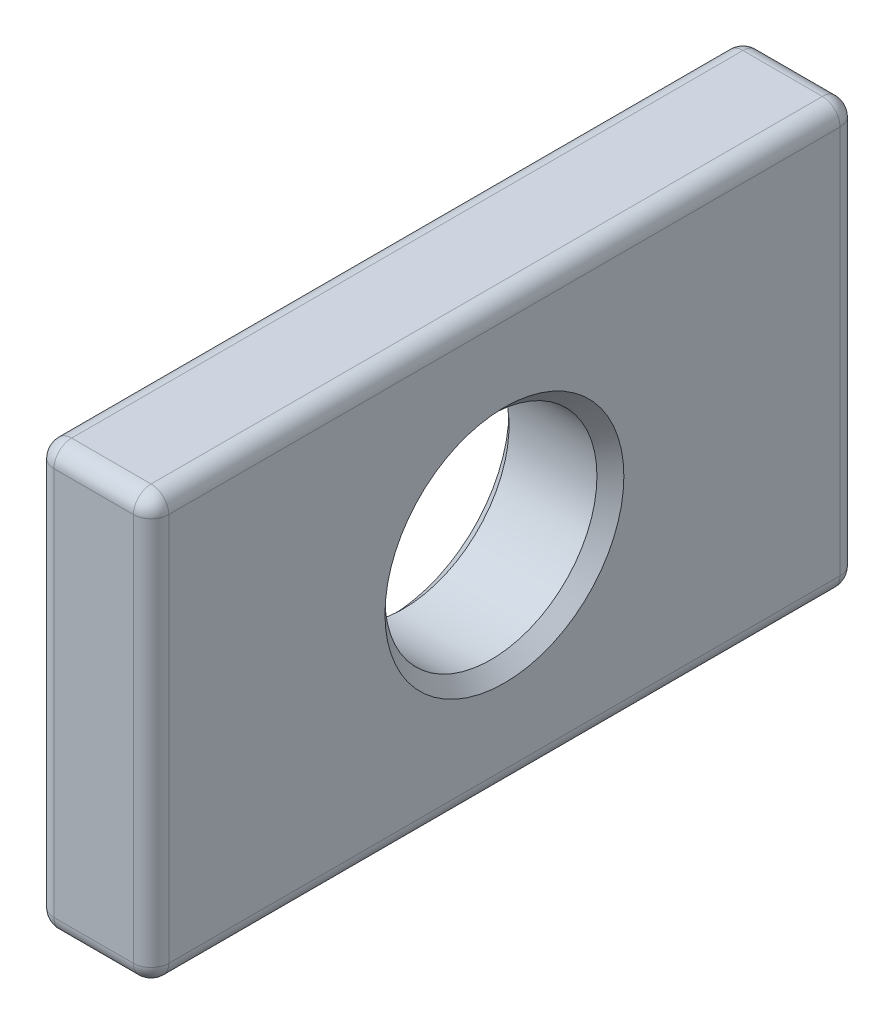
from build123d import *

# Parameters (mm, degrees)
SKETCH1_W           = 40
SKETCH1_H           = 24
SKETCH1_R           = 6
BOSS_EXTRUDE1_DEPTH = 3.25
FILLET1_R           = 1
CHAMFER1_SIZE       = 0.762


with BuildPart() as part:
    # Sketch1 → Boss-Extrude1 (new, symmetric)
    with BuildSketch(Plane(origin=(0, 0, 0), x_dir=(0, 0, -1), z_dir=(1, 0, 0))):
        Rectangle(SKETCH1_W, SKETCH1_H)
        with Locations(Location((0, 0, 0), (0, 0, 180))):
            Circle(SKETCH1_R, mode=Mode.SUBTRACT)
    extrude(amount=BOSS_EXTRUDE1_DEPTH, both=True)

    # Fillet1
    fillet1_edges = [part.edges().sort_by_distance(p)[0] for p in [
        (3.25, 0, 20),
        (3.25, -12, 0),
        (3.25, 0, -20),
        (-3.25, -12, 0),
        (-3.25, 0, 20),
        (-3.25, 12, 0),
        (-3.25, 0, -20),
        (3.25, 12, 0),
        (0, -12, -20),
        (0, -12, 20),
        (0, 12, 20),
        (0, 12, -20),
    ]]
    fillet(fillet1_edges, radius=FILLET1_R)

    # Chamfer1
    chamfer1_edges = [part.edges().sort_by_distance(p)[0] for p in [
        (-3.25, 0, -6),
        (3.25, 0, -6),
    ]]
    chamfer(chamfer1_edges, length=CHAMFER1_SIZE)


solid = part.part
